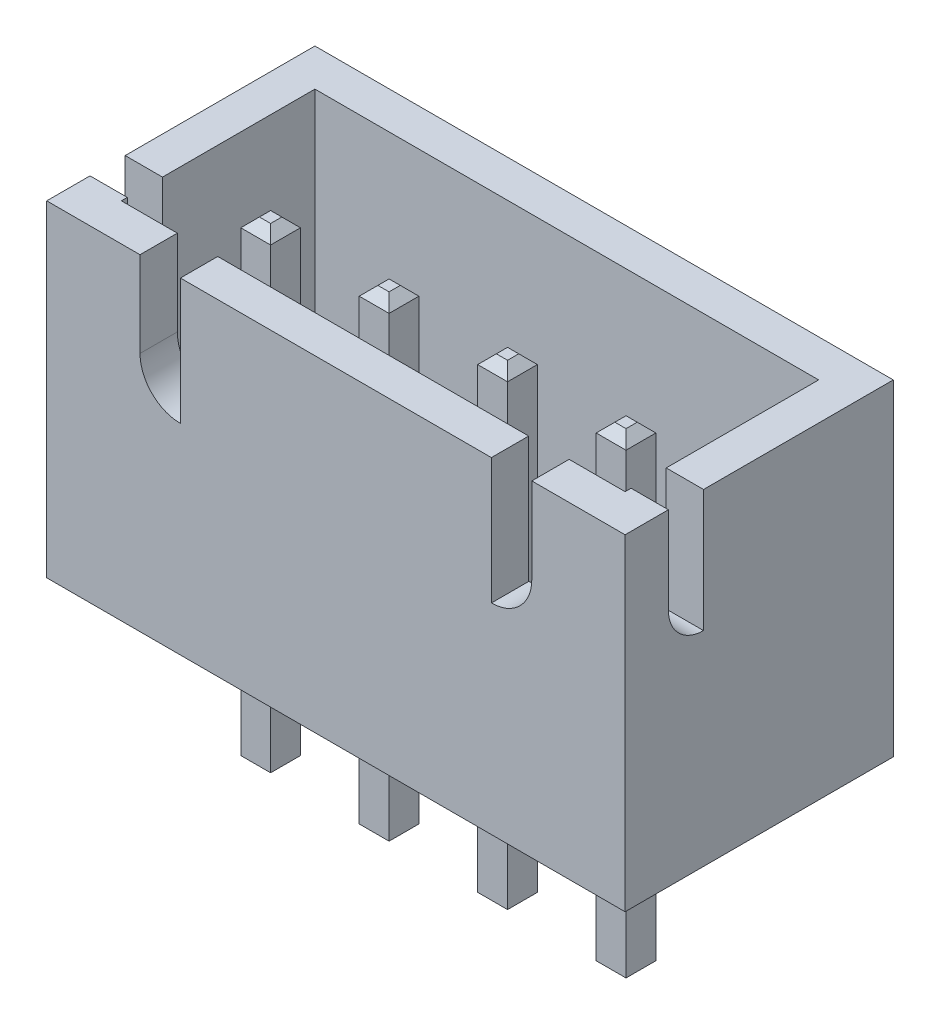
from build123d import *

# Parameters (mm, degrees)
SKETCH1_W                = 12.4
SKETCH1_H                = 5.75
BOSS_EXTRUDE1_DEPTH      = 7
SHELL1_T                 = -0.8
CUT_EXTRUDE1_DEPTH       = 15.526721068
CUT_EXTRUDE2_REACH       = 12.977
BOSS_EXTRUDE2_DEPTH      = 3.45
BOSS_EXTRUDE2_DEPTH_BACK = 6.75
SKETCH4_W                = 0.64
SKETCH4_H                = 0.64
CHAMFER1_SIZE            = 0.2


with BuildPart() as part:
    # Sketch1 → Boss-Extrude1 (new body)
    with BuildSketch(Plane(origin=(0, 0, 0), x_dir=(1, 0, 0), z_dir=(0, 1, 0))):
        Rectangle(SKETCH1_W, SKETCH1_H)
    extrude(amount=BOSS_EXTRUDE1_DEPTH)

    # Shell1
    shell1_openings = [part.faces().sort_by_distance(p)[0] for p in [
        (0, 7, 0),
    ]]
    offset(amount=SHELL1_T, openings=shell1_openings, kind=Kind.INTERSECTION)

    # Sketch2 → Cut-Extrude1 (cut, through all)
    with BuildSketch(Plane(origin=(6.2, 0, 0), x_dir=(0, 0, -1), z_dir=(1, 0, 0))):
        with BuildLine():
            Line((-1.19301282, 7), (-1.19301282, 4.379603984))
            ThreePointArc((-1.19301282, 4.379603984), (-1.72610374, 4.600417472), (-1.946917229, 5.133508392))
            Line((-1.946917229, 5.133508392), (-1.946917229, 7))
            Line((-1.946917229, 7), (-1.19301282, 7))
        make_face()
    extrude(amount=-CUT_EXTRUDE1_DEPTH, mode=Mode.SUBTRACT)

    # Sketch3 → Cut-Extrude2 (cut, up to next)
    with BuildSketch(Plane.XY.offset(2.875), mode=Mode.PRIVATE) as cut_extrude2_sk1:
        with BuildLine():
            Line((-4.2, 7), (-4.2, 6.728922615))
            Line((-4.2, 6.728922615), (-4.2, 5.166308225))
            ThreePointArc((-4.2, 5.166308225), (-3.946286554, 4.553789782), (-3.33376811, 4.300076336))
            Line((-3.33376811, 4.300076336), (-3.33376811, 7))
            Line((-3.33376811, 7), (-4.2, 7))
        make_face()
    cut_extrude2_tool1 = extrude(cut_extrude2_sk1.sketch, amount=-CUT_EXTRUDE2_REACH, mode=Mode.PRIVATE) & part.part
    # Sketch3 → Cut-Extrude2 (cut, up to next)
    with BuildSketch(Plane.XY.offset(2.875), mode=Mode.PRIVATE) as cut_extrude2_sk2:
        with BuildLine():
            Line((3.33376811, 7), (4.2, 7))
            Line((4.2, 7), (4.2, 6.728922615))
            Line((4.2, 6.728922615), (4.2, 5.166308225))
            ThreePointArc((4.2, 5.166308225), (3.946286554, 4.553789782), (3.33376811, 4.300076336))
            Line((3.33376811, 4.300076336), (3.33376811, 7))
        make_face()
    cut_extrude2_tool2 = extrude(cut_extrude2_sk2.sketch, amount=-CUT_EXTRUDE2_REACH, mode=Mode.PRIVATE) & part.part
    add(cut_extrude2_tool1.solids().sort_by_distance((-3.749165, 5.735551, 2.875))[0], mode=Mode.SUBTRACT)
    add(cut_extrude2_tool2.solids().sort_by_distance((3.749165, 5.735551, 2.875))[0], mode=Mode.SUBTRACT)

    # Sketch4 → Boss-Extrude2 (add, two sides: drawn at the far end of the back side and taken through both)
    with BuildSketch(Plane.XZ.offset(-BOSS_EXTRUDE2_DEPTH_BACK)):
        with Locations((-3.75, 0.525)):
            Rectangle(SKETCH4_W, SKETCH4_H)
        with Locations((-1.21, 0.525)):
            Rectangle(SKETCH4_W, SKETCH4_H)
        with Locations((1.33, 0.525)):
            Rectangle(SKETCH4_W, SKETCH4_H)
        with Locations((3.87, 0.525)):
            Rectangle(SKETCH4_W, SKETCH4_H)
    extrude(amount=BOSS_EXTRUDE2_DEPTH + BOSS_EXTRUDE2_DEPTH_BACK)

    # Chamfer1
    chamfer1_edges = [part.edges().sort_by_distance(p)[0] for p in [
        (-1.21, 6.75, 0.205),
        (-1.53, 6.75, 0.525),
        (-1.21, 6.75, 0.845),
        (-0.89, 6.75, 0.525),
        (-1.21, -3.45, 0.205),
        (-0.89, -3.45, 0.525),
        (-1.21, -3.45, 0.845),
        (-1.53, -3.45, 0.525),
        (1.33, 6.75, 0.205),
        (1.01, 6.75, 0.525),
        (1.33, 6.75, 0.845),
        (1.65, 6.75, 0.525),
        (1.33, -3.45, 0.205),
        (1.65, -3.45, 0.525),
        (1.33, -3.45, 0.845),
        (1.01, -3.45, 0.525),
        (3.87, 6.75, 0.205),
        (3.55, 6.75, 0.525),
        (3.87, 6.75, 0.845),
        (4.19, 6.75, 0.525),
        (3.87, -3.45, 0.205),
        (4.19, -3.45, 0.525),
        (3.87, -3.45, 0.845),
        (3.55, -3.45, 0.525),
        (-3.43, 6.75, 0.525),
        (-3.75, 6.75, 0.205),
        (-4.07, 6.75, 0.525),
        (-3.75, 6.75, 0.845),
        (-3.43, -3.45, 0.525),
        (-3.75, -3.45, 0.845),
        (-4.07, -3.45, 0.525),
        (-3.75, -3.45, 0.205),
    ]]
    chamfer(chamfer1_edges, length=CHAMFER1_SIZE)


solid = part.part
